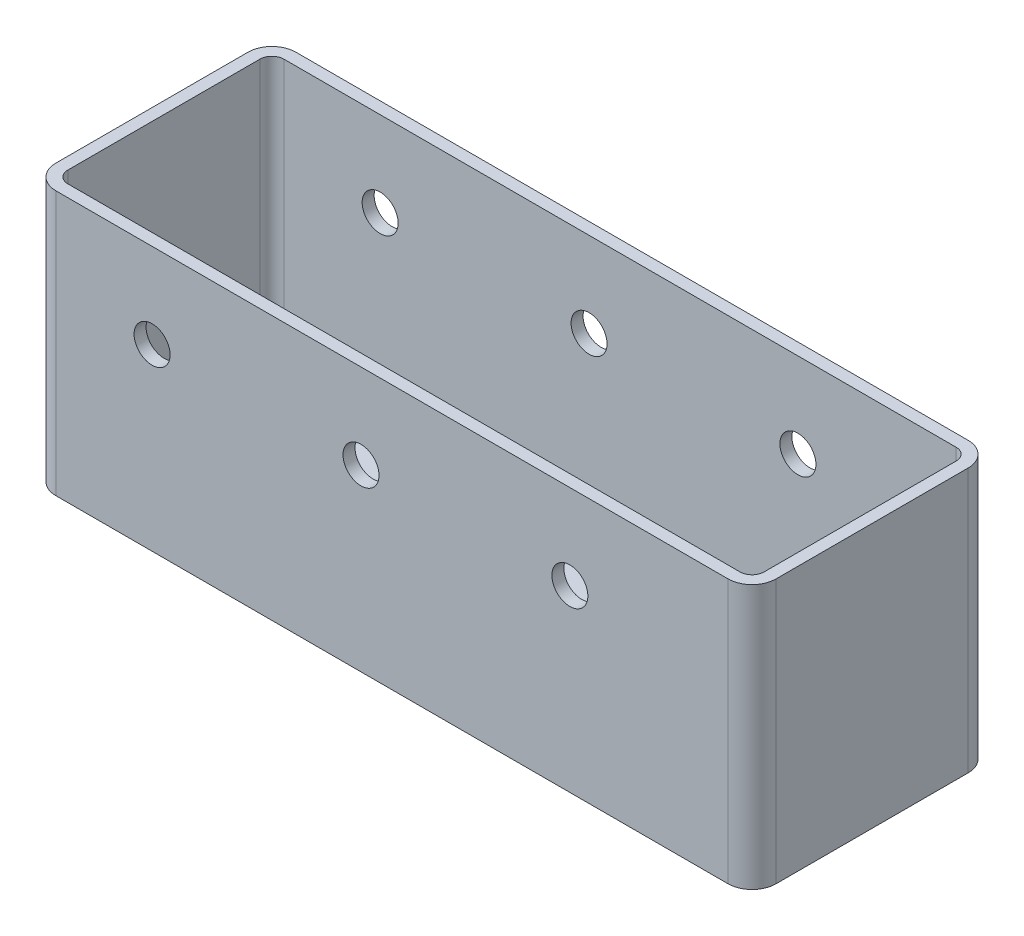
from build123d import *

# Parameters (mm, degrees)
BOSS_EXTRUDE1_DEPTH = 12.7
BOSS_EXTRUDE2_DEPTH = 266.7
SKETCH5_R           = 19.05
CUT_EXTRUDE1_DEPTH  = 190.5


with BuildPart() as part:
    # Sketch2 → Boss-Extrude1 (new body)
    with BuildSketch(Plane(origin=(0, 0, 0), x_dir=(1, 0, 0), z_dir=(0, 1, 0))):
        with BuildLine():
            Line((355.6, 127), (-355.6, 127))
            ThreePointArc((-355.6, 127), (-373.560512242, 119.560512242), (-381, 101.6))
            Line((-381, 101.6), (-381, -101.6))
            ThreePointArc((-381, -101.6), (-373.560512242, -119.560512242), (-355.6, -127))
            Line((-355.6, -127), (355.6, -127))
            ThreePointArc((355.6, -127), (373.560512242, -119.560512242), (381, -101.6))
            Line((381, -101.6), (381, 101.6))
            ThreePointArc((381, 101.6), (373.560512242, 119.560512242), (355.6, 127))
        make_face()
    extrude(amount=BOSS_EXTRUDE1_DEPTH)

    # Sketch4 → Boss-Extrude2 (add)
    with BuildSketch(Plane(origin=(0, 12.7, 0), x_dir=(1, 0, 0), z_dir=(0, 1, 0))):
        with BuildLine():
            Line((381, -101.6), (381, 101.6))
            ThreePointArc((381, 101.6), (373.560512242, 119.560512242), (355.6, 127))
            Line((355.6, 127), (-355.6, 127))
            ThreePointArc((-355.6, 127), (-373.560512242, 119.560512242), (-381, 101.6))
            Line((-381, 101.6), (-381, -101.6))
            ThreePointArc((-381, -101.6), (-373.560512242, -119.560512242), (-355.6, -127))
            Line((-355.6, -127), (355.6, -127))
            ThreePointArc((355.6, -127), (373.560512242, -119.560512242), (381, -101.6))
        make_face()
        with BuildLine():
            Line((-368.3, 101.6), (-368.3, -101.6))
            ThreePointArc((-368.3, -101.6), (-364.580256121, -110.580256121), (-355.6, -114.3))
            Line((-355.6, -114.3), (355.6, -114.3))
            ThreePointArc((355.6, -114.3), (364.580256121, -110.580256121), (368.3, -101.6))
            Line((368.3, -101.6), (368.3, 101.6))
            ThreePointArc((368.3, 101.6), (364.580256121, 110.580256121), (355.6, 114.3))
            Line((355.6, 114.3), (-355.6, 114.3))
            ThreePointArc((-355.6, 114.3), (-364.580256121, 110.580256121), (-368.3, 101.6))
        make_face(mode=Mode.SUBTRACT)
    extrude(amount=BOSS_EXTRUDE2_DEPTH)

    # Sketch5 → Cut-Extrude1 (cut, symmetric)
    with BuildSketch(Plane.XY):
        with Locations((-253.79825288, 189.484)):
            Circle(SKETCH5_R)
        with Locations((-32.766, 189.484)):
            Circle(SKETCH5_R)
        with Locations((188.214, 189.484)):
            Circle(SKETCH5_R)
    extrude(amount=CUT_EXTRUDE1_DEPTH, both=True, mode=Mode.SUBTRACT)


solid = part.part
